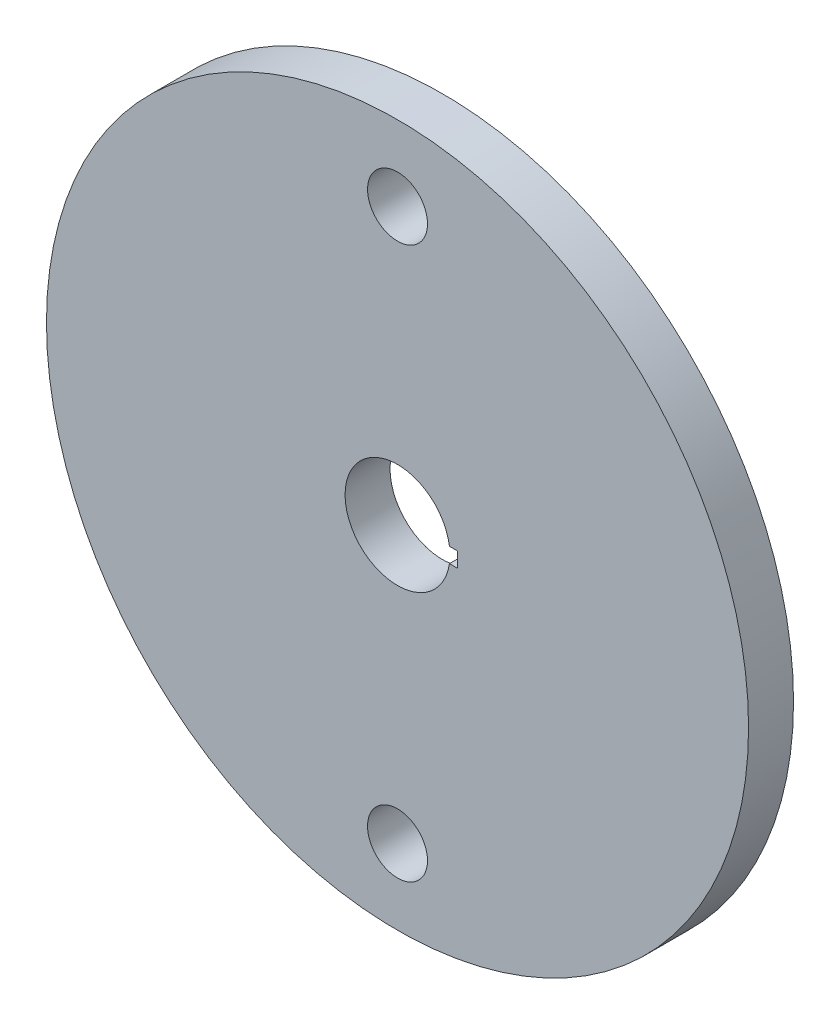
from build123d import *

# Parameters (mm, degrees)
SKETCH1_R           = 29.747577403
BOSS_EXTRUDE1_DEPTH = 3.81
CUT_EXTRUDE1_DEPTH  = 5.08
SKETCH3_R           = 2.54
CUT_EXTRUDE2_DEPTH  = 5.08


with BuildPart() as part:
    # Sketch1 → Boss-Extrude1 (new body)
    with BuildSketch(Plane.XY):
        with Locations(Location((127, 31.75, 0), (0, 0, 180))):
            Circle(SKETCH1_R)
    extrude(amount=BOSS_EXTRUDE1_DEPTH)

    # Sketch2 → Cut-Extrude1 (cut)
    with BuildSketch(Plane.XY.offset(3.81)):
        with BuildLine():
            Line((130.81, 31.115), (130.81, 32.385))
            Line((130.81, 32.385), (131.399409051, 32.385))
            ThreePointArc((131.399409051, 32.385), (122.555, 31.75), (131.399409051, 31.115))
            Line((131.399409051, 31.115), (130.81, 31.115))
        make_face()
        with BuildLine():
            Line((131.399409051, 32.385), (130.81, 32.385))
            Line((130.81, 32.385), (130.81, 31.115))
            Line((130.81, 31.115), (131.399409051, 31.115))
            ThreePointArc((131.399409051, 31.115), (131.433587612, 31.431682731), (131.445, 31.75))
            ThreePointArc((131.445, 31.75), (131.433587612, 32.068317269), (131.399409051, 32.385))
        make_face()
        with BuildLine():
            Line((132.08, 32.385), (131.399409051, 32.385))
            ThreePointArc((131.399409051, 32.385), (131.433587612, 32.068317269), (131.445, 31.75))
            ThreePointArc((131.445, 31.75), (131.433587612, 31.431682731), (131.399409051, 31.115))
            Line((131.399409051, 31.115), (132.08, 31.115))
            Line((132.08, 31.115), (132.08, 32.385))
        make_face()
        with BuildLine():
            Line((130.81, 31.115), (130.81, 32.385))
            Line((130.81, 32.385), (131.399409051, 32.385))
            ThreePointArc((131.399409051, 32.385), (122.555, 31.75), (131.399409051, 31.115))
            Line((131.399409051, 31.115), (130.81, 31.115))
        make_face()
        with BuildLine():
            Line((131.399409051, 32.385), (130.81, 32.385))
            Line((130.81, 32.385), (130.81, 31.115))
            Line((130.81, 31.115), (131.399409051, 31.115))
            ThreePointArc((131.399409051, 31.115), (131.433587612, 31.431682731), (131.445, 31.75))
            ThreePointArc((131.445, 31.75), (131.433587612, 32.068317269), (131.399409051, 32.385))
        make_face()
    extrude(amount=-CUT_EXTRUDE1_DEPTH, mode=Mode.SUBTRACT)

    # Sketch3 → Cut-Extrude2 (cut)
    with BuildSketch(Plane.XY.offset(3.81)):
        with Locations((127, 55.118)):
            Circle(SKETCH3_R)
        with Locations((127, 8.382)):
            Circle(SKETCH3_R)
    extrude(amount=-CUT_EXTRUDE2_DEPTH, mode=Mode.SUBTRACT)


solid = part.part
